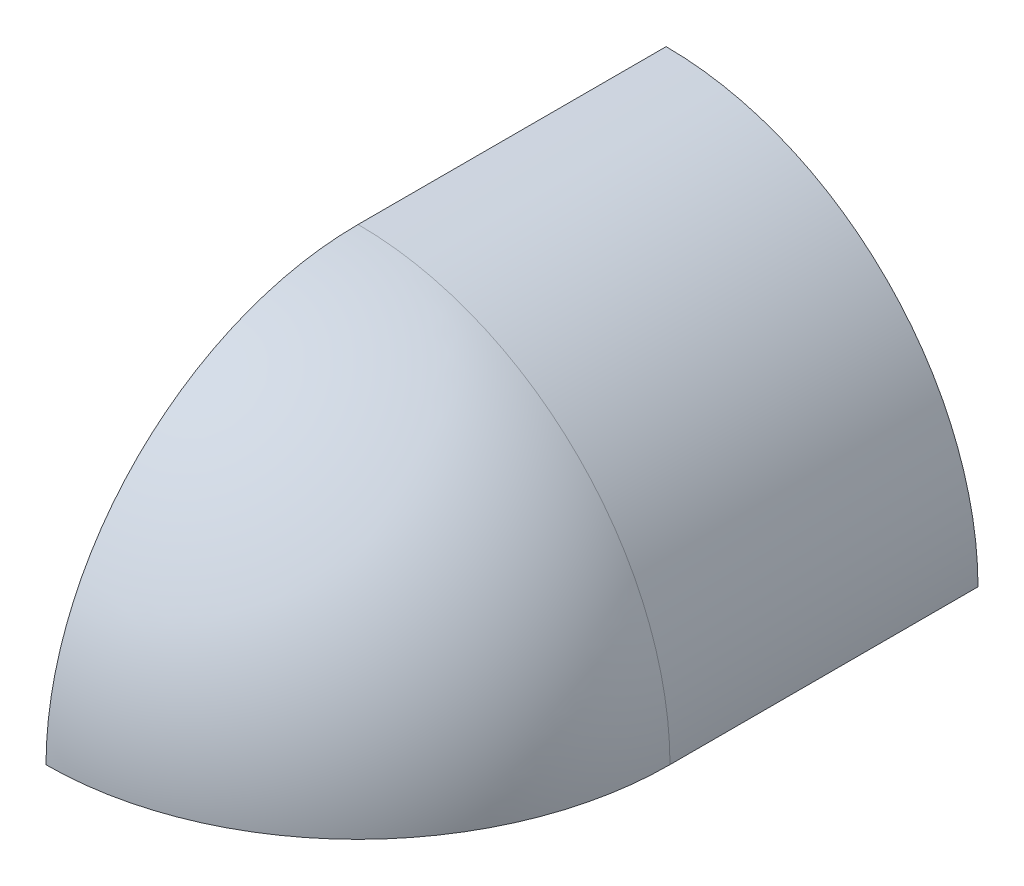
ISO-10303-21;
HEADER;
FILE_DESCRIPTION(('STEP AP214'),'2;1');
FILE_NAME('part.step','',(''),(''),'','','');
FILE_SCHEMA(('AUTOMOTIVE_DESIGN { 1 0 10303 214 1 1 1 1 }'));
ENDSEC;
DATA;
#1=APPLICATION_CONTEXT('core data for automotive mechanical design processes');
#2=APPLICATION_PROTOCOL_DEFINITION('international standard','automotive_design',2000,#1);
#3=PRODUCT_CONTEXT('',#1,'mechanical');
#4=PRODUCT('Part','Part','',(#3));
#5=PRODUCT_RELATED_PRODUCT_CATEGORY('part','',(#4));
#6=PRODUCT_DEFINITION_FORMATION('','',#4);
#7=PRODUCT_DEFINITION_CONTEXT('part definition',#1,'design');
#8=PRODUCT_DEFINITION('design','',#6,#7);
#9=PRODUCT_DEFINITION_SHAPE('','',#8);
#10=(LENGTH_UNIT() NAMED_UNIT(*) SI_UNIT(.MILLI.,.METRE.));
#11=(NAMED_UNIT(*) PLANE_ANGLE_UNIT() SI_UNIT($,.RADIAN.));
#12=(NAMED_UNIT(*) SI_UNIT($,.STERADIAN.) SOLID_ANGLE_UNIT());
#13=UNCERTAINTY_MEASURE_WITH_UNIT(LENGTH_MEASURE(1.E-05),#10,'distance_accuracy_value','');
#14=(GEOMETRIC_REPRESENTATION_CONTEXT(3) GLOBAL_UNCERTAINTY_ASSIGNED_CONTEXT((#13)) GLOBAL_UNIT_ASSIGNED_CONTEXT((#10,
#11,#12)) REPRESENTATION_CONTEXT('',''));
#15=CARTESIAN_POINT('',(0.,0.,0.));
#16=DIRECTION('',(0.,0.,1.));
#17=DIRECTION('',(1.,0.,0.));
#18=AXIS2_PLACEMENT_3D('',#15,#16,#17);
#19=CARTESIAN_POINT('',(0.,0.,-0.803161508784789));
#20=DIRECTION('',(0.,0.,1.));
#21=DIRECTION('',(1.,0.,0.));
#22=AXIS2_PLACEMENT_3D('',#19,#20,#21);
#23=SPHERICAL_SURFACE('',#22,40.9612469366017);
#24=CARTESIAN_POINT('',(0.,0.,-0.803161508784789));
#25=DIRECTION('',(1.,0.,0.));
#26=DIRECTION('',(0.,0.,-1.));
#27=AXIS2_PLACEMENT_3D('',#24,#25,#26);
#28=CIRCLE('',#27,40.9612469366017);
#29=CARTESIAN_POINT('',(0.,40.9612369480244,-0.8317672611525));
#30=VERTEX_POINT('',#29);
#31=CARTESIAN_POINT('',(0.,0.,40.158085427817));
#32=VERTEX_POINT('',#31);
#33=EDGE_CURVE('E71',#30,#32,#28,.T.);
#34=ORIENTED_EDGE('',*,*,#33,.T.);
#35=CARTESIAN_POINT('',(0.,0.,-0.803161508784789));
#36=DIRECTION('',(0.,-1.,0.));
#37=DIRECTION('',(0.,0.,-1.));
#38=AXIS2_PLACEMENT_3D('',#35,#36,#37);
#39=CIRCLE('',#38,40.9612469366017);
#40=CARTESIAN_POINT('',(40.9612369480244,-1.43015394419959E-13,-0.8317672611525));
#41=VERTEX_POINT('',#40);
#42=EDGE_CURVE('E76',#41,#32,#39,.T.);
#43=ORIENTED_EDGE('',*,*,#42,.F.);
#44=CARTESIAN_POINT('',(0.,0.,-0.8317672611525));
#45=DIRECTION('',(0.,0.,1.));
#46=DIRECTION('',(1.,0.,0.));
#47=AXIS2_PLACEMENT_3D('',#44,#45,#46);
#48=CIRCLE('',#47,40.9612369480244);
#49=EDGE_CURVE('E39',#41,#30,#48,.T.);
#50=ORIENTED_EDGE('',*,*,#49,.T.);
#51=EDGE_LOOP('',(#34,#43,#50));
#52=FACE_BOUND('',#51,.T.);
#53=ADVANCED_FACE('F31',(#52),#23,.T.);
#54=CARTESIAN_POINT('',(40.9612369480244,-1.43015394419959E-13,-41.2846812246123));
#55=DIRECTION('',(0.,0.,1.));
#56=DIRECTION('',(1.,0.,0.));
#57=AXIS2_PLACEMENT_3D('',#54,#55,#56);
#58=PLANE('',#57);
#59=CARTESIAN_POINT('',(0.,0.,-41.2846812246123));
#60=DIRECTION('',(0.,0.,1.));
#61=DIRECTION('',(1.,0.,0.));
#62=AXIS2_PLACEMENT_3D('',#59,#60,#61);
#63=CIRCLE('',#62,40.9612369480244);
#64=CARTESIAN_POINT('',(40.9612369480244,-1.43015394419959E-13,-41.2846812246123));
#65=VERTEX_POINT('',#64);
#66=CARTESIAN_POINT('',(0.,40.9612369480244,-41.2846812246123));
#67=VERTEX_POINT('',#66);
#68=EDGE_CURVE('E11',#65,#67,#63,.T.);
#69=ORIENTED_EDGE('',*,*,#68,.F.);
#70=DIRECTION('',(1.,0.,0.));
#71=VECTOR('',#70,1.);
#72=CARTESIAN_POINT('',(40.9612369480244,-1.43015394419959E-13,-41.2846812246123));
#73=LINE('',#72,#71);
#74=CARTESIAN_POINT('',(0.,0.,-41.2846812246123));
#75=VERTEX_POINT('',#74);
#76=EDGE_CURVE('E68',#75,#65,#73,.T.);
#77=ORIENTED_EDGE('',*,*,#76,.F.);
#78=DIRECTION('',(0.,1.,0.));
#79=VECTOR('',#78,1.);
#80=CARTESIAN_POINT('',(0.,40.9612369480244,-41.2846812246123));
#81=LINE('',#80,#79);
#82=EDGE_CURVE('E67',#75,#67,#81,.T.);
#83=ORIENTED_EDGE('',*,*,#82,.T.);
#84=EDGE_LOOP('',(#69,#77,#83));
#85=FACE_BOUND('',#84,.T.);
#86=ADVANCED_FACE('F33',(#85),#58,.F.);
#87=CARTESIAN_POINT('',(0.,0.,51.0810719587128));
#88=DIRECTION('',(0.,0.,1.));
#89=DIRECTION('',(1.,0.,0.));
#90=AXIS2_PLACEMENT_3D('',#87,#88,#89);
#91=CYLINDRICAL_SURFACE('',#90,40.9612369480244);
#92=DIRECTION('',(0.,0.,1.));
#93=VECTOR('',#92,1.);
#94=CARTESIAN_POINT('',(40.9612369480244,-1.43015394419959E-13,-0.8317672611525));
#95=LINE('',#94,#93);
#96=EDGE_CURVE('E66',#65,#41,#95,.T.);
#97=ORIENTED_EDGE('',*,*,#96,.F.);
#98=ORIENTED_EDGE('',*,*,#68,.T.);
#99=DIRECTION('',(0.,0.,1.));
#100=VECTOR('',#99,1.);
#101=CARTESIAN_POINT('',(0.,40.9612369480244,-0.8317672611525));
#102=LINE('',#101,#100);
#103=EDGE_CURVE('E64',#67,#30,#102,.T.);
#104=ORIENTED_EDGE('',*,*,#103,.T.);
#105=ORIENTED_EDGE('',*,*,#49,.F.);
#106=EDGE_LOOP('',(#97,#98,#104,#105));
#107=FACE_BOUND('',#106,.T.);
#108=ADVANCED_FACE('F62',(#107),#91,.T.);
#109=CARTESIAN_POINT('',(0.,0.,-0.803161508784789));
#110=DIRECTION('',(0.,-1.,0.));
#111=DIRECTION('',(0.,0.,-1.));
#112=AXIS2_PLACEMENT_3D('',#109,#110,#111);
#113=PLANE('',#112);
#114=ORIENTED_EDGE('',*,*,#42,.T.);
#115=DIRECTION('',(0.,0.,-1.));
#116=VECTOR('',#115,1.);
#117=CARTESIAN_POINT('',(0.,0.,40.158085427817));
#118=LINE('',#117,#116);
#119=EDGE_CURVE('E79',#32,#75,#118,.T.);
#120=ORIENTED_EDGE('',*,*,#119,.T.);
#121=ORIENTED_EDGE('',*,*,#76,.T.);
#122=ORIENTED_EDGE('',*,*,#96,.T.);
#123=EDGE_LOOP('',(#114,#120,#121,#122));
#124=FACE_BOUND('',#123,.T.);
#125=ADVANCED_FACE('F87',(#124),#113,.T.);
#126=CARTESIAN_POINT('',(0.,0.,-0.803161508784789));
#127=DIRECTION('',(1.,0.,0.));
#128=DIRECTION('',(0.,0.,-1.));
#129=AXIS2_PLACEMENT_3D('',#126,#127,#128);
#130=PLANE('',#129);
#131=ORIENTED_EDGE('',*,*,#33,.F.);
#132=ORIENTED_EDGE('',*,*,#103,.F.);
#133=ORIENTED_EDGE('',*,*,#82,.F.);
#134=ORIENTED_EDGE('',*,*,#119,.F.);
#135=EDGE_LOOP('',(#131,#132,#133,#134));
#136=FACE_BOUND('',#135,.T.);
#137=ADVANCED_FACE('F74',(#136),#130,.F.);
#138=CLOSED_SHELL('',(#53,#86,#108,#125,#137));
#139=MANIFOLD_SOLID_BREP('B2',#138);
#140=ADVANCED_BREP_SHAPE_REPRESENTATION('',(#18,#139),#14);
#141=SHAPE_DEFINITION_REPRESENTATION(#9,#140);
ENDSEC;
END-ISO-10303-21;
